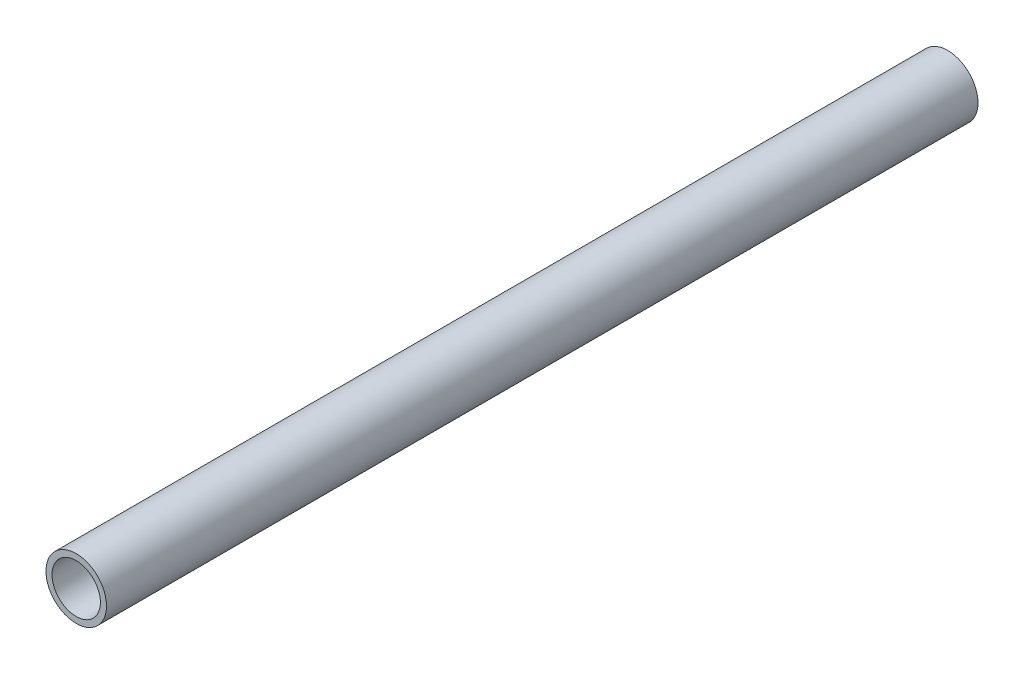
ISO-10303-21;
HEADER;
FILE_DESCRIPTION(('STEP AP214'),'2;1');
FILE_NAME('part.step','',(''),(''),'','','');
FILE_SCHEMA(('AUTOMOTIVE_DESIGN { 1 0 10303 214 1 1 1 1 }'));
ENDSEC;
DATA;
#1=APPLICATION_CONTEXT('core data for automotive mechanical design processes');
#2=APPLICATION_PROTOCOL_DEFINITION('international standard','automotive_design',2000,#1);
#3=PRODUCT_CONTEXT('',#1,'mechanical');
#4=PRODUCT('Part','Part','',(#3));
#5=PRODUCT_RELATED_PRODUCT_CATEGORY('part','',(#4));
#6=PRODUCT_DEFINITION_FORMATION('','',#4);
#7=PRODUCT_DEFINITION_CONTEXT('part definition',#1,'design');
#8=PRODUCT_DEFINITION('design','',#6,#7);
#9=PRODUCT_DEFINITION_SHAPE('','',#8);
#10=(LENGTH_UNIT() NAMED_UNIT(*) SI_UNIT(.MILLI.,.METRE.));
#11=(NAMED_UNIT(*) PLANE_ANGLE_UNIT() SI_UNIT($,.RADIAN.));
#12=(NAMED_UNIT(*) SI_UNIT($,.STERADIAN.) SOLID_ANGLE_UNIT());
#13=UNCERTAINTY_MEASURE_WITH_UNIT(LENGTH_MEASURE(1.E-05),#10,'distance_accuracy_value','');
#14=(GEOMETRIC_REPRESENTATION_CONTEXT(3) GLOBAL_UNCERTAINTY_ASSIGNED_CONTEXT((#13)) GLOBAL_UNIT_ASSIGNED_CONTEXT((#10,
#11,#12)) REPRESENTATION_CONTEXT('',''));
#15=CARTESIAN_POINT('',(0.,0.,0.));
#16=DIRECTION('',(0.,0.,1.));
#17=DIRECTION('',(1.,0.,0.));
#18=AXIS2_PLACEMENT_3D('',#15,#16,#17);
#19=CARTESIAN_POINT('',(0.,0.,14.4));
#20=DIRECTION('',(0.,0.,1.));
#21=DIRECTION('',(1.,0.,0.));
#22=AXIS2_PLACEMENT_3D('',#19,#20,#21);
#23=PLANE('',#22);
#24=CARTESIAN_POINT('',(0.,0.,14.4));
#25=DIRECTION('',(0.,0.,1.));
#26=DIRECTION('',(1.,0.,0.));
#27=AXIS2_PLACEMENT_3D('',#24,#25,#26);
#28=CIRCLE('',#27,0.5);
#29=CARTESIAN_POINT('',(0.5,0.,14.4));
#30=VERTEX_POINT('',#29);
#31=EDGE_CURVE('E10',#30,#30,#28,.T.);
#32=ORIENTED_EDGE('',*,*,#31,.T.);
#33=EDGE_LOOP('',(#32));
#34=FACE_BOUND('',#33,.T.);
#35=CARTESIAN_POINT('',(0.,0.,14.4));
#36=DIRECTION('',(0.,0.,1.));
#37=DIRECTION('',(1.,0.,0.));
#38=AXIS2_PLACEMENT_3D('',#35,#36,#37);
#39=CIRCLE('',#38,0.4);
#40=CARTESIAN_POINT('',(0.4,0.,14.4));
#41=VERTEX_POINT('',#40);
#42=EDGE_CURVE('E40',#41,#41,#39,.T.);
#43=ORIENTED_EDGE('',*,*,#42,.F.);
#44=EDGE_LOOP('',(#43));
#45=FACE_BOUND('',#44,.T.);
#46=ADVANCED_FACE('F29',(#34,#45),#23,.T.);
#47=CARTESIAN_POINT('',(0.,0.,0.));
#48=DIRECTION('',(0.,0.,1.));
#49=DIRECTION('',(1.,0.,0.));
#50=AXIS2_PLACEMENT_3D('',#47,#48,#49);
#51=PLANE('',#50);
#52=CARTESIAN_POINT('',(0.,0.,0.));
#53=DIRECTION('',(0.,0.,1.));
#54=DIRECTION('',(1.,0.,0.));
#55=AXIS2_PLACEMENT_3D('',#52,#53,#54);
#56=CIRCLE('',#55,0.5);
#57=CARTESIAN_POINT('',(0.5,0.,0.));
#58=VERTEX_POINT('',#57);
#59=EDGE_CURVE('E33',#58,#58,#56,.T.);
#60=ORIENTED_EDGE('',*,*,#59,.F.);
#61=EDGE_LOOP('',(#60));
#62=FACE_BOUND('',#61,.T.);
#63=CARTESIAN_POINT('',(0.,0.,0.));
#64=DIRECTION('',(0.,0.,1.));
#65=DIRECTION('',(1.,0.,0.));
#66=AXIS2_PLACEMENT_3D('',#63,#64,#65);
#67=CIRCLE('',#66,0.4);
#68=CARTESIAN_POINT('',(0.4,0.,0.));
#69=VERTEX_POINT('',#68);
#70=EDGE_CURVE('E42',#69,#69,#67,.T.);
#71=ORIENTED_EDGE('',*,*,#70,.T.);
#72=EDGE_LOOP('',(#71));
#73=FACE_BOUND('',#72,.T.);
#74=ADVANCED_FACE('F52',(#62,#73),#51,.F.);
#75=CARTESIAN_POINT('',(0.,0.,14.4));
#76=DIRECTION('',(0.,0.,-1.));
#77=DIRECTION('',(-1.,0.,0.));
#78=AXIS2_PLACEMENT_3D('',#75,#76,#77);
#79=CYLINDRICAL_SURFACE('',#78,0.5);
#80=ORIENTED_EDGE('',*,*,#31,.F.);
#81=EDGE_LOOP('',(#80));
#82=FACE_BOUND('',#81,.T.);
#83=ORIENTED_EDGE('',*,*,#59,.T.);
#84=EDGE_LOOP('',(#83));
#85=FACE_BOUND('',#84,.T.);
#86=ADVANCED_FACE('F31',(#82,#85),#79,.T.);
#87=CARTESIAN_POINT('',(0.,0.,14.4));
#88=DIRECTION('',(0.,0.,-1.));
#89=DIRECTION('',(-1.,0.,0.));
#90=AXIS2_PLACEMENT_3D('',#87,#88,#89);
#91=CYLINDRICAL_SURFACE('',#90,0.4);
#92=ORIENTED_EDGE('',*,*,#42,.T.);
#93=EDGE_LOOP('',(#92));
#94=FACE_BOUND('',#93,.T.);
#95=ORIENTED_EDGE('',*,*,#70,.F.);
#96=EDGE_LOOP('',(#95));
#97=FACE_BOUND('',#96,.T.);
#98=ADVANCED_FACE('F48',(#94,#97),#91,.F.);
#99=CLOSED_SHELL('',(#46,#74,#86,#98));
#100=MANIFOLD_SOLID_BREP('B2',#99);
#101=ADVANCED_BREP_SHAPE_REPRESENTATION('',(#18,#100),#14);
#102=SHAPE_DEFINITION_REPRESENTATION(#9,#101);
ENDSEC;
END-ISO-10303-21;
